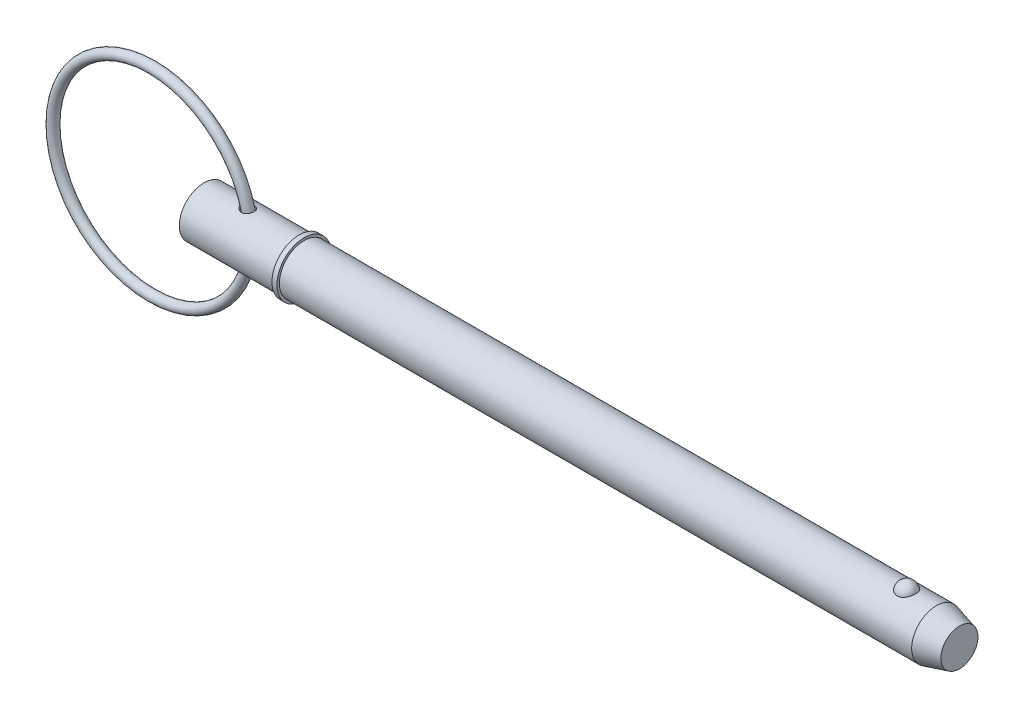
ISO-10303-21;
HEADER;
FILE_DESCRIPTION(('STEP AP214'),'2;1');
FILE_NAME('part.step','',(''),(''),'','','');
FILE_SCHEMA(('AUTOMOTIVE_DESIGN { 1 0 10303 214 1 1 1 1 }'));
ENDSEC;
DATA;
#1=APPLICATION_CONTEXT('core data for automotive mechanical design processes');
#2=APPLICATION_PROTOCOL_DEFINITION('international standard','automotive_design',2000,#1);
#3=PRODUCT_CONTEXT('',#1,'mechanical');
#4=PRODUCT('Part','Part','',(#3));
#5=PRODUCT_RELATED_PRODUCT_CATEGORY('part','',(#4));
#6=PRODUCT_DEFINITION_FORMATION('','',#4);
#7=PRODUCT_DEFINITION_CONTEXT('part definition',#1,'design');
#8=PRODUCT_DEFINITION('design','',#6,#7);
#9=PRODUCT_DEFINITION_SHAPE('','',#8);
#10=(LENGTH_UNIT() NAMED_UNIT(*) SI_UNIT(.MILLI.,.METRE.));
#11=(NAMED_UNIT(*) PLANE_ANGLE_UNIT() SI_UNIT($,.RADIAN.));
#12=(NAMED_UNIT(*) SI_UNIT($,.STERADIAN.) SOLID_ANGLE_UNIT());
#13=UNCERTAINTY_MEASURE_WITH_UNIT(LENGTH_MEASURE(1.E-05),#10,'distance_accuracy_value','');
#14=(GEOMETRIC_REPRESENTATION_CONTEXT(3) GLOBAL_UNCERTAINTY_ASSIGNED_CONTEXT((#13)) GLOBAL_UNIT_ASSIGNED_CONTEXT((#10,
#11,#12)) REPRESENTATION_CONTEXT('',''));
#15=CARTESIAN_POINT('',(0.,0.,0.));
#16=DIRECTION('',(0.,0.,1.));
#17=DIRECTION('',(1.,0.,0.));
#18=AXIS2_PLACEMENT_3D('',#15,#16,#17);
#19=CARTESIAN_POINT('',(-13.3798047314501,0.,0.));
#20=DIRECTION('',(0.,0.,1.));
#21=DIRECTION('',(1.,0.,0.));
#22=AXIS2_PLACEMENT_3D('',#19,#20,#21);
#23=TOROIDAL_SURFACE('',#22,25.4,1.27);
#24=CARTESIAN_POINT('',(13.2901952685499,0.,0.));
#25=VERTEX_POINT('',#24);
#26=VERTEX_LOOP('',#25);
#27=FACE_BOUND('',#26,.T.);
#28=ADVANCED_FACE('P0_F12',(#27),#23,.T.);
#29=CLOSED_SHELL('',(#28));
#30=MANIFOLD_SOLID_BREP('P0_B1',#29);
#31=CARTESIAN_POINT('',(0.,0.,0.));
#32=DIRECTION('',(1.,0.,0.));
#33=DIRECTION('',(0.,0.,-1.));
#34=AXIS2_PLACEMENT_3D('',#31,#32,#33);
#35=CYLINDRICAL_SURFACE('',#34,6.35);
#36=CARTESIAN_POINT('',(9.67500140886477,6.32698634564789,-0.540133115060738));
#37=CARTESIAN_POINT('',(9.70878953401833,6.3197498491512,-0.624879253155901));
#38=CARTESIAN_POINT('',(9.75028044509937,6.31105328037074,-0.706504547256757));
#39=CARTESIAN_POINT('',(9.84659255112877,6.29180070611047,-0.861319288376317));
#40=CARTESIAN_POINT('',(9.90144039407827,6.28124099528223,-0.934491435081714));
#41=CARTESIAN_POINT('',(10.021999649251,6.25949497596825,-1.0704877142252));
#42=CARTESIAN_POINT('',(10.0876589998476,6.2483118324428,-1.1333586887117));
#43=CARTESIAN_POINT('',(10.2280180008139,6.22641783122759,-1.24805262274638));
#44=CARTESIAN_POINT('',(10.3027159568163,6.21570688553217,-1.29987764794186));
#45=CARTESIAN_POINT('',(10.4650889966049,6.19509606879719,-1.39492899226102));
#46=CARTESIAN_POINT('',(10.5533142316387,6.1853135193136,-1.4372443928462));
#47=CARTESIAN_POINT('',(10.7357818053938,6.16871128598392,-1.50691441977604));
#48=CARTESIAN_POINT('',(10.8300253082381,6.16189217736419,-1.53426614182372));
#49=CARTESIAN_POINT('',(11.0227953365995,6.15211299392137,-1.57302798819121));
#50=CARTESIAN_POINT('',(11.1213511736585,6.14918579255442,-1.58430237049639));
#51=CARTESIAN_POINT('',(11.3189518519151,6.1478413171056,-1.58951619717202));
#52=CARTESIAN_POINT('',(11.417996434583,6.14942187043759,-1.58346399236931));
#53=CARTESIAN_POINT('',(11.6070859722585,6.15678569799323,-1.55457003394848));
#54=CARTESIAN_POINT('',(11.6973059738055,6.16229943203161,-1.53280404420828));
#55=CARTESIAN_POINT('',(11.8723373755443,6.176630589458,-1.4739892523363));
#56=CARTESIAN_POINT('',(11.9571502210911,6.185447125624,-1.43694455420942));
#57=CARTESIAN_POINT('',(12.1146737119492,6.20482821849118,-1.3507217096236));
#58=CARTESIAN_POINT('',(12.1877743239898,6.21528554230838,-1.30222952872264));
#59=CARTESIAN_POINT('',(12.324618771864,6.23705116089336,-1.19362916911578));
#60=CARTESIAN_POINT('',(12.3883628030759,6.24835943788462,-1.1335212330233));
#61=CARTESIAN_POINT('',(12.5046662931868,6.27053957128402,-1.00357204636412));
#62=CARTESIAN_POINT('',(12.5572571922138,6.28141258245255,-0.933759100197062));
#63=CARTESIAN_POINT('',(12.6502125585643,6.30157953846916,-0.786214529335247));
#64=CARTESIAN_POINT('',(12.6905764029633,6.31087340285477,-0.708482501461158));
#65=CARTESIAN_POINT('',(12.7585531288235,6.32699259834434,-0.546246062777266));
#66=CARTESIAN_POINT('',(12.7860022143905,6.33378599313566,-0.461669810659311));
#67=CARTESIAN_POINT('',(12.8267605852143,6.34401050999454,-0.288980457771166));
#68=CARTESIAN_POINT('',(12.8400695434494,6.34744155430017,-0.200867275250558));
#69=CARTESIAN_POINT('',(12.8522644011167,6.35058177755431,-0.0231943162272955));
#70=CARTESIAN_POINT('',(12.8510870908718,6.35027464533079,0.0663700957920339));
#71=CARTESIAN_POINT('',(12.8341831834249,6.34593169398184,0.244024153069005));
#72=CARTESIAN_POINT('',(12.8184563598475,6.341895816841,0.332113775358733));
#73=CARTESIAN_POINT('',(12.7728208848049,6.33052992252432,0.504322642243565));
#74=CARTESIAN_POINT('',(12.7429114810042,6.32319973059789,0.588441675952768));
#75=CARTESIAN_POINT('',(12.6696162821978,6.30604116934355,0.750316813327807));
#76=CARTESIAN_POINT('',(12.6262302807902,6.29621276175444,0.828072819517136));
#77=CARTESIAN_POINT('',(12.5270856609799,6.27515240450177,0.974918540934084));
#78=CARTESIAN_POINT('',(12.4713403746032,6.26392197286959,1.04401746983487));
#79=CARTESIAN_POINT('',(12.3488662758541,6.24131002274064,1.1716478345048));
#80=CARTESIAN_POINT('',(12.2821384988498,6.22992851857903,1.23018026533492));
#81=CARTESIAN_POINT('',(12.1401870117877,6.20841765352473,1.33449214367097));
#82=CARTESIAN_POINT('',(12.0650507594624,6.19827734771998,1.38038832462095));
#83=CARTESIAN_POINT('',(11.9079044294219,6.18026478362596,1.45892404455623));
#84=CARTESIAN_POINT('',(11.8258951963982,6.17239224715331,1.49156520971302));
#85=CARTESIAN_POINT('',(11.6581736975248,6.15982613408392,1.54263810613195));
#86=CARTESIAN_POINT('',(11.572502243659,6.15510409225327,1.56119728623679));
#87=CARTESIAN_POINT('',(11.3991899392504,6.14916283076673,1.58443707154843));
#88=CARTESIAN_POINT('',(11.3115488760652,6.14794399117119,1.58911617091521));
#89=CARTESIAN_POINT('',(11.1345547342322,6.14904466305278,1.58485137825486));
#90=CARTESIAN_POINT('',(11.0452104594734,6.15144894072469,1.5755811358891));
#91=CARTESIAN_POINT('',(10.8691479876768,6.15957601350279,1.54349959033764));
#92=CARTESIAN_POINT('',(10.782430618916,6.16529984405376,1.52068406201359));
#93=CARTESIAN_POINT('',(10.6082848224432,6.17983892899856,1.4605156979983));
#94=CARTESIAN_POINT('',(10.5211557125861,6.1888262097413,1.42233764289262));
#95=CARTESIAN_POINT('',(10.3542377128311,6.20874782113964,1.33268652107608));
#96=CARTESIAN_POINT('',(10.2744521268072,6.21968302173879,1.28120750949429));
#97=CARTESIAN_POINT('',(10.120854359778,6.24282707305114,1.16334748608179));
#98=CARTESIAN_POINT('',(10.0474902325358,6.25507146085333,1.09638652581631));
#99=CARTESIAN_POINT('',(9.91368693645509,6.27890019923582,0.950453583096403));
#100=CARTESIAN_POINT('',(9.85324511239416,6.29048468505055,0.87148407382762));
#101=CARTESIAN_POINT('',(9.75037543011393,6.31102161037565,0.707140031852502));
#102=CARTESIAN_POINT('',(9.70726585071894,6.32006820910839,0.622206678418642));
#103=CARTESIAN_POINT('',(9.63775895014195,6.33497125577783,0.445490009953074));
#104=CARTESIAN_POINT('',(9.61134627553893,6.34083063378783,0.35371307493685));
#105=CARTESIAN_POINT('',(9.57891955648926,6.34807071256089,0.177220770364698));
#106=CARTESIAN_POINT('',(9.5709352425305,6.3498832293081,0.0928817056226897));
#107=CARTESIAN_POINT('',(9.56994851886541,6.35010532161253,-0.0758268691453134));
#108=CARTESIAN_POINT('',(9.57692695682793,6.34851924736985,-0.160196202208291));
#109=CARTESIAN_POINT('',(9.59985709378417,6.34339435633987,-0.294043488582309));
#110=CARTESIAN_POINT('',(9.61128951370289,6.34084912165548,-0.34438537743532));
#111=CARTESIAN_POINT('',(9.63933183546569,6.33468615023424,-0.443526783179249));
#112=CARTESIAN_POINT('',(9.65594100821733,6.33106856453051,-0.492326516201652));
#113=CARTESIAN_POINT('',(9.67500140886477,6.32698634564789,-0.540133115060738));
#114=B_SPLINE_CURVE_WITH_KNOTS('',3,(#36,#37,#38,#39,#40,#41,#42,#43,#44,#45,#46,#47,#48,#49,
#50,#51,#52,#53,#54,#55,#56,#57,#58,#59,#60,#61,#62,#63,#64,#65,#66,#67,#68,#69,#70,#71,#72,#73,
#74,#75,#76,#77,#78,#79,#80,#81,#82,#83,#84,#85,#86,#87,#88,#89,#90,#91,#92,#93,#94,#95,#96,#97,
#98,#99,#100,#101,#102,#103,#104,#105,#106,#107,#108,#109,#110,#111,#112,#113),.UNSPECIFIED.,
.T.,.F.,(4,2,2,2,2,2,2,2,2,2,2,2,2,2,2,2,2,2,2,2,2,2,2,2,2,2,2,2,2,2,2,2,2,2,2,2,2,2,4),(0.,
0.274348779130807,0.54924945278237,0.822863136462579,1.09642560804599,1.3900770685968,
1.68378550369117,1.97995934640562,2.27599046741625,2.55347281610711,2.83088067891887,
3.09465189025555,3.35841759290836,3.62142956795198,3.88445494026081,4.1507318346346,
4.4170148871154,4.68446025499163,4.95190978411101,5.21937350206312,5.48684131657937,
5.75402200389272,6.02117751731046,6.28577524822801,6.55034050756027,6.81248178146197,
7.0746514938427,7.34305086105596,7.61153399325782,7.89692981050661,8.18245340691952,
8.48120635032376,8.77989784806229,9.06530254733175,9.35044442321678,9.60331609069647,
9.85586427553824,10.010650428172,10.1654147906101),.UNSPECIFIED.);
#115=CARTESIAN_POINT('',(9.67500140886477,6.32698634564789,-0.540133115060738));
#116=VERTEX_POINT('',#115);
#117=EDGE_CURVE('P1_E42',#116,#116,#114,.T.);
#118=ORIENTED_EDGE('',*,*,#117,.T.);
#119=EDGE_LOOP('',(#118));
#120=FACE_BOUND('',#119,.T.);
#121=CARTESIAN_POINT('',(0.,0.,0.));
#122=DIRECTION('',(1.,0.,0.));
#123=DIRECTION('',(0.,0.,-1.));
#124=AXIS2_PLACEMENT_3D('',#121,#122,#123);
#125=CIRCLE('',#124,6.35);
#126=CARTESIAN_POINT('',(0.,0.,-6.35));
#127=VERTEX_POINT('',#126);
#128=EDGE_CURVE('P1_E9',#127,#127,#125,.T.);
#129=ORIENTED_EDGE('',*,*,#128,.T.);
#130=EDGE_LOOP('',(#129));
#131=FACE_BOUND('',#130,.T.);
#132=CARTESIAN_POINT('',(24.43,0.,0.));
#133=DIRECTION('',(1.,0.,0.));
#134=DIRECTION('',(0.,0.,-1.));
#135=AXIS2_PLACEMENT_3D('',#132,#133,#134);
#136=CIRCLE('',#135,6.35);
#137=CARTESIAN_POINT('',(24.43,0.,-6.35));
#138=VERTEX_POINT('',#137);
#139=EDGE_CURVE('P1_E25',#138,#138,#136,.T.);
#140=ORIENTED_EDGE('',*,*,#139,.F.);
#141=EDGE_LOOP('',(#140));
#142=FACE_BOUND('',#141,.T.);
#143=CARTESIAN_POINT('',(9.67500140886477,-6.32698634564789,-0.540133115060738));
#144=CARTESIAN_POINT('',(9.64544894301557,-6.33331515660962,-0.46600258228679));
#145=CARTESIAN_POINT('',(9.62177180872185,-6.33852974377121,-0.389437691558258));
#146=CARTESIAN_POINT('',(9.58727043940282,-6.34619174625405,-0.233330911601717));
#147=CARTESIAN_POINT('',(9.57644043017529,-6.34864040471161,-0.153790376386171));
#148=CARTESIAN_POINT('',(9.56819517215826,-6.3505010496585,0.00612071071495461));
#149=CARTESIAN_POINT('',(9.57079639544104,-6.34990930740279,0.0864921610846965));
#150=CARTESIAN_POINT('',(9.58930797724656,-6.3457478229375,0.245607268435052));
#151=CARTESIAN_POINT('',(9.60522046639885,-6.34217760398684,0.324350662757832));
#152=CARTESIAN_POINT('',(9.64931570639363,-6.3324977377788,0.47727605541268));
#153=CARTESIAN_POINT('',(9.67737525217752,-6.32641361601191,0.551495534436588));
#154=CARTESIAN_POINT('',(9.74451510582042,-6.31231128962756,0.69455132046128));
#155=CARTESIAN_POINT('',(9.78359827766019,-6.30429258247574,0.763386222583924));
#156=CARTESIAN_POINT('',(9.87474700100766,-6.28638332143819,0.899414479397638));
#157=CARTESIAN_POINT('',(9.92757481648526,-6.27639669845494,0.966083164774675));
#158=CARTESIAN_POINT('',(10.042675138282,-6.25596164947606,1.09061181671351));
#159=CARTESIAN_POINT('',(10.1049521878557,-6.24551300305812,1.14846751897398));
#160=CARTESIAN_POINT('',(10.2445505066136,-6.22397505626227,1.26024641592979));
#161=CARTESIAN_POINT('',(10.3227711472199,-6.2129394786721,1.31305951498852));
#162=CARTESIAN_POINT('',(10.4867924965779,-6.19263757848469,1.40570084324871));
#163=CARTESIAN_POINT('',(10.5725962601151,-6.18337197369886,1.44552380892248));
#164=CARTESIAN_POINT('',(10.7543302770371,-6.16725983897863,1.51283687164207));
#165=CARTESIAN_POINT('',(10.8505554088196,-6.16056505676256,1.53957358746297));
#166=CARTESIAN_POINT('',(11.0463546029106,-6.15127671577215,1.57628137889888));
#167=CARTESIAN_POINT('',(11.1459276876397,-6.14868197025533,1.58625730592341));
#168=CARTESIAN_POINT('',(11.3414257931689,-6.14810798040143,1.58848000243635));
#169=CARTESIAN_POINT('',(11.4373417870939,-6.14995283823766,1.58140242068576));
#170=CARTESIAN_POINT('',(11.6262783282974,-6.1577972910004,1.55057566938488));
#171=CARTESIAN_POINT('',(11.719300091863,-6.16379511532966,1.52683360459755));
#172=CARTESIAN_POINT('',(11.8934223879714,-6.17873566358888,1.46514575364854));
#173=CARTESIAN_POINT('',(11.9749048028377,-6.18746207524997,1.42822144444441));
#174=CARTESIAN_POINT('',(12.1301362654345,-6.20693584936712,1.34105645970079));
#175=CARTESIAN_POINT('',(12.2038861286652,-6.21768299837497,1.29081719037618));
#176=CARTESIAN_POINT('',(12.3399792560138,-6.23970077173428,1.17972764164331));
#177=CARTESIAN_POINT('',(12.4025430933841,-6.25095401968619,1.11914355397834));
#178=CARTESIAN_POINT('',(12.5166805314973,-6.27296916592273,0.988307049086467));
#179=CARTESIAN_POINT('',(12.568253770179,-6.28373104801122,0.918054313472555));
#180=CARTESIAN_POINT('',(12.6596230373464,-6.3037060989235,0.769081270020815));
#181=CARTESIAN_POINT('',(12.6992956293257,-6.31290263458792,0.690283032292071));
#182=CARTESIAN_POINT('',(12.7652258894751,-6.32862394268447,0.527011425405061));
#183=CARTESIAN_POINT('',(12.7914829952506,-6.33514860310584,0.442537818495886));
#184=CARTESIAN_POINT('',(12.8301436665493,-6.34487485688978,0.269505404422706));
#185=CARTESIAN_POINT('',(12.8424230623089,-6.34804664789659,0.180917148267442));
#186=CARTESIAN_POINT('',(12.8524214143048,-6.35062347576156,0.00286829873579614));
#187=CARTESIAN_POINT('',(12.8501402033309,-6.35002846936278,-0.0865923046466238));
#188=CARTESIAN_POINT('',(12.8310619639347,-6.34513332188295,-0.263931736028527));
#189=CARTESIAN_POINT('',(12.8142517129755,-6.34082980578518,-0.35180904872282));
#190=CARTESIAN_POINT('',(12.7664911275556,-6.32897674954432,-0.523406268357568));
#191=CARTESIAN_POINT('',(12.7355404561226,-6.3214271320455,-0.607126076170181));
#192=CARTESIAN_POINT('',(12.6602298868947,-6.30390232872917,-0.768030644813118));
#193=CARTESIAN_POINT('',(12.6158695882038,-6.29392707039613,-0.845215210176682));
#194=CARTESIAN_POINT('',(12.5148171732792,-6.2726521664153,-0.990836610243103));
#195=CARTESIAN_POINT('',(12.4581254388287,-6.26135256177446,-1.05927371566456));
#196=CARTESIAN_POINT('',(12.33416419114,-6.2387572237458,-1.18510935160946));
#197=CARTESIAN_POINT('',(12.2669484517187,-6.22746174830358,-1.24256086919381));
#198=CARTESIAN_POINT('',(12.1235592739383,-6.20610255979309,-1.34519464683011));
#199=CARTESIAN_POINT('',(12.0473871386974,-6.19603866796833,-1.39037868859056));
#200=CARTESIAN_POINT('',(11.8892714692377,-6.17839642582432,-1.46678006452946));
#201=CARTESIAN_POINT('',(11.8074126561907,-6.17078838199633,-1.49816605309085));
#202=CARTESIAN_POINT('',(11.6394563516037,-6.15869606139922,-1.54712759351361));
#203=CARTESIAN_POINT('',(11.5533589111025,-6.15421174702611,-1.56470331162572));
#204=CARTESIAN_POINT('',(11.3789660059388,-6.14876652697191,-1.58596734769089));
#205=CARTESIAN_POINT('',(11.2906621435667,-6.1478222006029,-1.58959032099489));
#206=CARTESIAN_POINT('',(11.1146029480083,-6.149490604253,-1.58312110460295));
#207=CARTESIAN_POINT('',(11.0268477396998,-6.1521041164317,-1.57302589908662));
#208=CARTESIAN_POINT('',(10.8498668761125,-6.16071031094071,-1.53898332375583));
#209=CARTESIAN_POINT('',(10.7607726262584,-6.16685908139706,-1.51439468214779));
#210=CARTESIAN_POINT('',(10.5876521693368,-6.18189031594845,-1.45181305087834));
#211=CARTESIAN_POINT('',(10.5036282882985,-6.19077402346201,-1.41381396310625));
#212=CARTESIAN_POINT('',(10.3374228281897,-6.2109378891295,-1.32252480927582));
#213=CARTESIAN_POINT('',(10.255708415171,-6.2223355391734,-1.26840756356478));
#214=CARTESIAN_POINT('',(10.1025645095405,-6.24580740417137,-1.14725208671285));
#215=CARTESIAN_POINT('',(10.0311354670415,-6.25788164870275,-1.08021329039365));
#216=CARTESIAN_POINT('',(9.90472699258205,-6.2806176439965,-0.938710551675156));
#217=CARTESIAN_POINT('',(9.84904456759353,-6.29132066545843,-0.864883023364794));
#218=CARTESIAN_POINT('',(9.75129345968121,-6.31084098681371,-0.708496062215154));
#219=CARTESIAN_POINT('',(9.70921094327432,-6.31966019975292,-0.625945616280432));
#220=CARTESIAN_POINT('',(9.67500140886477,-6.32698634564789,-0.540133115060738));
#221=B_SPLINE_CURVE_WITH_KNOTS('',3,(#143,#144,#145,#146,#147,#148,#149,#150,#151,#152,#153,
#154,#155,#156,#157,#158,#159,#160,#161,#162,#163,#164,#165,#166,#167,#168,#169,#170,#171,#172,
#173,#174,#175,#176,#177,#178,#179,#180,#181,#182,#183,#184,#185,#186,#187,#188,#189,#190,#191,
#192,#193,#194,#195,#196,#197,#198,#199,#200,#201,#202,#203,#204,#205,#206,#207,#208,#209,#210,
#211,#212,#213,#214,#215,#216,#217,#218,#219,#220),.UNSPECIFIED.,.T.,.F.,(4,2,2,2,2,2,2,2,2,2,2,
2,2,2,2,2,2,2,2,2,2,2,2,2,2,2,2,2,2,2,2,2,2,2,2,2,2,2,4),(0.,0.239871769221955,
0.479635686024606,0.719693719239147,0.959790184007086,1.19750645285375,1.43528453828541,
1.69117930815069,1.94719750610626,2.23102979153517,2.51497694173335,2.81376497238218,
3.11246650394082,3.39952951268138,3.68647020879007,3.95479420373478,4.22308987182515,
4.48530700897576,4.74753278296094,5.01239119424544,5.27726070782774,5.54446524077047,
5.81167284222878,6.07912387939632,6.34658129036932,6.61404669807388,6.88150382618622,
7.1476364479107,7.41373039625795,7.67647472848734,7.93921589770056,8.20318607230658,
8.46721428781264,8.74390821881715,9.02072813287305,9.31537622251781,9.61003720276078,
9.88799314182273,10.1656654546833),.UNSPECIFIED.);
#222=CARTESIAN_POINT('',(9.67500140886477,-6.32698634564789,-0.540133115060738));
#223=VERTEX_POINT('',#222);
#224=EDGE_CURVE('P1_E17',#223,#223,#221,.T.);
#225=ORIENTED_EDGE('',*,*,#224,.T.);
#226=EDGE_LOOP('',(#225));
#227=FACE_BOUND('',#226,.T.);
#228=ADVANCED_FACE('P1_F13',(#120,#131,#142,#227),#35,.T.);
#229=CARTESIAN_POINT('',(0.,0.,0.));
#230=DIRECTION('',(1.,0.,0.));
#231=DIRECTION('',(0.,0.,-1.));
#232=AXIS2_PLACEMENT_3D('',#229,#230,#231);
#233=CYLINDRICAL_SURFACE('',#232,6.35);
#234=CARTESIAN_POINT('',(188.055369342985,0.,0.));
#235=DIRECTION('',(1.,0.,0.));
#236=DIRECTION('',(0.,0.,-1.));
#237=AXIS2_PLACEMENT_3D('',#234,#235,#236);
#238=CIRCLE('',#237,6.35);
#239=CARTESIAN_POINT('',(188.055369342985,0.,-6.35));
#240=VERTEX_POINT('',#239);
#241=EDGE_CURVE('P1_E99',#240,#240,#238,.T.);
#242=ORIENTED_EDGE('',*,*,#241,.F.);
#243=EDGE_LOOP('',(#242));
#244=FACE_BOUND('',#243,.T.);
#245=CARTESIAN_POINT('',(25.7,0.,0.));
#246=DIRECTION('',(1.,0.,0.));
#247=DIRECTION('',(0.,0.,-1.));
#248=AXIS2_PLACEMENT_3D('',#245,#246,#247);
#249=CIRCLE('',#248,6.35);
#250=CARTESIAN_POINT('',(25.7,0.,-6.35));
#251=VERTEX_POINT('',#250);
#252=EDGE_CURVE('P1_E96',#251,#251,#249,.T.);
#253=ORIENTED_EDGE('',*,*,#252,.T.);
#254=EDGE_LOOP('',(#253));
#255=FACE_BOUND('',#254,.T.);
#256=CARTESIAN_POINT('',(180.430021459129,5.87502187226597,2.40969251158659));
#257=CARTESIAN_POINT('',(180.305030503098,5.87501645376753,2.40969773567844));
#258=CARTESIAN_POINT('',(180.180080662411,5.87916061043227,2.39967292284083));
#259=CARTESIAN_POINT('',(179.933909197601,5.8952311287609,2.35991730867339));
#260=CARTESIAN_POINT('',(179.812686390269,5.90715499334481,2.33019283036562));
#261=CARTESIAN_POINT('',(179.577517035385,5.93739567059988,2.25201402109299));
#262=CARTESIAN_POINT('',(179.463560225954,5.95570321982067,2.20358681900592));
#263=CARTESIAN_POINT('',(179.24557352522,5.9967206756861,2.089379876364));
#264=CARTESIAN_POINT('',(179.141545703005,6.01943149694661,2.02359652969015));
#265=CARTESIAN_POINT('',(178.942943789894,6.06760647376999,1.87428969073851));
#266=CARTESIAN_POINT('',(178.848726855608,6.09313095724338,1.79031110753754));
#267=CARTESIAN_POINT('',(178.675255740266,6.14375873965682,1.60800178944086));
#268=CARTESIAN_POINT('',(178.596004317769,6.16886196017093,1.50966841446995));
#269=CARTESIAN_POINT('',(178.450845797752,6.21724600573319,1.29645884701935));
#270=CARTESIAN_POINT('',(178.385688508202,6.24039621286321,1.18104158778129));
#271=CARTESIAN_POINT('',(178.274703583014,6.28117277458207,0.940351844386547));
#272=CARTESIAN_POINT('',(178.228877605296,6.29879865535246,0.815078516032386));
#273=CARTESIAN_POINT('',(178.157023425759,6.32692073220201,0.556494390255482));
#274=CARTESIAN_POINT('',(178.131249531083,6.33732517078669,0.423102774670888));
#275=CARTESIAN_POINT('',(178.100988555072,6.34957673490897,0.153542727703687));
#276=CARTESIAN_POINT('',(178.096500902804,6.35142408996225,0.0173743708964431));
#277=CARTESIAN_POINT('',(178.108865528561,6.34638925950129,-0.253036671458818));
#278=CARTESIAN_POINT('',(178.125594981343,6.33955731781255,-0.387285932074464));
#279=CARTESIAN_POINT('',(178.179843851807,6.31794129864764,-0.650851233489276));
#280=CARTESIAN_POINT('',(178.217363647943,6.30315707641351,-0.780167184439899));
#281=CARTESIAN_POINT('',(178.312500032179,6.26711642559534,-1.03041949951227));
#282=CARTESIAN_POINT('',(178.370143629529,6.24585130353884,-1.1513443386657));
#283=CARTESIAN_POINT('',(178.504352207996,6.19905619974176,-1.38129800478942));
#284=CARTESIAN_POINT('',(178.580918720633,6.17352587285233,-1.49032586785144));
#285=CARTESIAN_POINT('',(178.751753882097,6.12080227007,-1.69393164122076));
#286=CARTESIAN_POINT('',(178.846100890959,6.09360200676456,-1.78844209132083));
#287=CARTESIAN_POINT('',(179.050119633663,6.04070434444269,-1.95970536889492));
#288=CARTESIAN_POINT('',(179.159790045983,6.01500681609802,-2.03645972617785));
#289=CARTESIAN_POINT('',(179.389187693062,5.96867714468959,-2.16845644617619));
#290=CARTESIAN_POINT('',(179.508652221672,5.94794910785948,-2.22412062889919));
#291=CARTESIAN_POINT('',(179.756218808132,5.91340580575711,-2.31440992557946));
#292=CARTESIAN_POINT('',(179.884317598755,5.8995879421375,-2.3490429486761));
#293=CARTESIAN_POINT('',(180.138582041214,5.88111049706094,-2.39491590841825));
#294=CARTESIAN_POINT('',(180.264520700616,5.876025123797,-2.40724512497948));
#295=CARTESIAN_POINT('',(180.516786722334,5.87428980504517,-2.41147867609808));
#296=CARTESIAN_POINT('',(180.643114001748,5.87763817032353,-2.40338710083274));
#297=CARTESIAN_POINT('',(180.888417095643,5.89212921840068,-2.367627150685));
#298=CARTESIAN_POINT('',(181.007499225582,5.90302431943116,-2.34058030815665));
#299=CARTESIAN_POINT('',(181.23924472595,5.93113752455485,-2.26839066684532));
#300=CARTESIAN_POINT('',(181.351907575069,5.94835614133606,-2.22324640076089));
#301=CARTESIAN_POINT('',(181.570400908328,5.98773016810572,-2.11493806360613));
#302=CARTESIAN_POINT('',(181.676028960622,6.00998499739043,-2.05140269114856));
#303=CARTESIAN_POINT('',(181.875300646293,6.05690144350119,-1.90842705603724));
#304=CARTESIAN_POINT('',(181.968941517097,6.08156361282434,-1.82898313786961));
#305=CARTESIAN_POINT('',(182.146675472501,6.13211715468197,-1.65182429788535));
#306=CARTESIAN_POINT('',(182.230055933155,6.15800825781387,-1.55339381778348));
#307=CARTESIAN_POINT('',(182.379790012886,6.20712834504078,-1.34374214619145));
#308=CARTESIAN_POINT('',(182.446140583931,6.23035685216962,-1.23251867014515));
#309=CARTESIAN_POINT('',(182.562345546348,6.27251177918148,-0.996447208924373));
#310=CARTESIAN_POINT('',(182.611607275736,6.29127762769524,-0.871278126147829));
#311=CARTESIAN_POINT('',(182.689614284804,6.3215862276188,-0.613870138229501));
#312=CARTESIAN_POINT('',(182.718359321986,6.33312889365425,-0.481631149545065));
#313=CARTESIAN_POINT('',(182.754770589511,6.34782349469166,-0.213672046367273));
#314=CARTESIAN_POINT('',(182.762413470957,6.35096613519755,-0.0779482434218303));
#315=CARTESIAN_POINT('',(182.756395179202,6.34851322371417,0.192943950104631));
#316=CARTESIAN_POINT('',(182.742734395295,6.3429178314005,0.328112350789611));
#317=CARTESIAN_POINT('',(182.69450361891,6.32360512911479,0.593406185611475));
#318=CARTESIAN_POINT('',(182.660031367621,6.30992579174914,0.723552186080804));
#319=CARTESIAN_POINT('',(182.570953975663,6.27586325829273,0.97583417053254));
#320=CARTESIAN_POINT('',(182.51634761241,6.25547965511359,1.09796966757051));
#321=CARTESIAN_POINT('',(182.38775879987,6.20998183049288,1.33148921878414));
#322=CARTESIAN_POINT('',(182.313674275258,6.18484288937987,1.44281227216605));
#323=CARTESIAN_POINT('',(182.147820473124,6.13258735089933,1.65087683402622));
#324=CARTESIAN_POINT('',(182.056051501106,6.10547078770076,1.74761859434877));
#325=CARTESIAN_POINT('',(181.857183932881,6.05235879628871,1.92350926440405));
#326=CARTESIAN_POINT('',(181.750133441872,6.0263601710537,2.00271146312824));
#327=CARTESIAN_POINT('',(181.523138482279,5.97843747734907,2.1415415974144));
#328=CARTESIAN_POINT('',(181.403191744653,5.95651412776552,2.20116608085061));
#329=CARTESIAN_POINT('',(181.144523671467,5.91812106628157,2.30250570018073));
#330=CARTESIAN_POINT('',(181.00506980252,5.90217533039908,2.34256795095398));
#331=CARTESIAN_POINT('',(180.720397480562,5.88063128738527,2.39615214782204));
#332=CARTESIAN_POINT('',(180.57518174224,5.8750281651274,2.40968644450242));
#333=CARTESIAN_POINT('',(180.430021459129,5.87502187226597,2.40969251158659));
#334=B_SPLINE_CURVE_WITH_KNOTS('',3,(#256,#257,#258,#259,#260,#261,#262,#263,#264,#265,#266,
#267,#268,#269,#270,#271,#272,#273,#274,#275,#276,#277,#278,#279,#280,#281,#282,#283,#284,#285,
#286,#287,#288,#289,#290,#291,#292,#293,#294,#295,#296,#297,#298,#299,#300,#301,#302,#303,#304,
#305,#306,#307,#308,#309,#310,#311,#312,#313,#314,#315,#316,#317,#318,#319,#320,#321,#322,#323,
#324,#325,#326,#327,#328,#329,#330,#331,#332,#333),.UNSPECIFIED.,.T.,.F.,(4,2,2,2,2,2,2,2,2,2,2,
2,2,2,2,2,2,2,2,2,2,2,2,2,2,2,2,2,2,2,2,2,2,2,2,2,2,2,4),(0.,0.374440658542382,
0.748761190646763,1.1225407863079,1.49639810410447,1.88098871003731,2.2656501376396,
2.66741104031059,3.06920639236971,3.47601794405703,3.88281858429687,4.28727498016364,
4.69173873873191,5.09674745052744,5.50178895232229,5.9086591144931,6.31549420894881,
6.71369855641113,7.11175305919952,7.48978077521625,7.86773278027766,8.23383886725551,
8.59997464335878,8.97409044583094,9.34829231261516,9.74122667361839,10.1342313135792,
10.5397522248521,10.9452779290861,11.3512521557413,11.7572189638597,12.1612938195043,
12.5653932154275,12.9716540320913,13.3779078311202,13.7829098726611,14.1879832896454,
14.6230486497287,15.0579114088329),.UNSPECIFIED.);
#335=CARTESIAN_POINT('',(180.430021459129,5.87502187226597,2.40969251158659));
#336=VERTEX_POINT('',#335);
#337=EDGE_CURVE('P1_E34',#336,#336,#334,.T.);
#338=ORIENTED_EDGE('',*,*,#337,.T.);
#339=EDGE_LOOP('',(#338));
#340=FACE_BOUND('',#339,.T.);
#341=ADVANCED_FACE('P1_F46',(#244,#255,#340),#233,.T.);
#342=CARTESIAN_POINT('',(0.,0.,0.));
#343=DIRECTION('',(-1.,0.,0.));
#344=DIRECTION('',(0.,0.,1.));
#345=AXIS2_PLACEMENT_3D('',#342,#343,#344);
#346=PLANE('',#345);
#347=ORIENTED_EDGE('',*,*,#128,.F.);
#348=EDGE_LOOP('',(#347));
#349=FACE_BOUND('',#348,.T.);
#350=ADVANCED_FACE('P1_F15',(#349),#346,.T.);
#351=CARTESIAN_POINT('',(24.43,6.35,0.));
#352=DIRECTION('',(-1.,0.,0.));
#353=DIRECTION('',(0.,0.,1.));
#354=AXIS2_PLACEMENT_3D('',#351,#352,#353);
#355=PLANE('',#354);
#356=ORIENTED_EDGE('',*,*,#139,.T.);
#357=EDGE_LOOP('',(#356));
#358=FACE_BOUND('',#357,.T.);
#359=CARTESIAN_POINT('',(24.43,0.,0.));
#360=DIRECTION('',(1.,0.,0.));
#361=DIRECTION('',(0.,0.,-1.));
#362=AXIS2_PLACEMENT_3D('',#359,#360,#361);
#363=CIRCLE('',#362,6.985);
#364=CARTESIAN_POINT('',(24.43,0.,-6.985));
#365=VERTEX_POINT('',#364);
#366=EDGE_CURVE('P1_E30',#365,#365,#363,.T.);
#367=ORIENTED_EDGE('',*,*,#366,.F.);
#368=EDGE_LOOP('',(#367));
#369=FACE_BOUND('',#368,.T.);
#370=ADVANCED_FACE('P1_F81',(#358,#369),#355,.T.);
#371=CARTESIAN_POINT('',(0.,0.,0.));
#372=DIRECTION('',(1.,0.,0.));
#373=DIRECTION('',(0.,0.,-1.));
#374=AXIS2_PLACEMENT_3D('',#371,#372,#373);
#375=CYLINDRICAL_SURFACE('',#374,6.985);
#376=ORIENTED_EDGE('',*,*,#366,.T.);
#377=EDGE_LOOP('',(#376));
#378=FACE_BOUND('',#377,.T.);
#379=CARTESIAN_POINT('',(25.7,0.,0.));
#380=DIRECTION('',(1.,0.,0.));
#381=DIRECTION('',(0.,0.,-1.));
#382=AXIS2_PLACEMENT_3D('',#379,#380,#381);
#383=CIRCLE('',#382,6.985);
#384=CARTESIAN_POINT('',(25.7,0.,-6.985));
#385=VERTEX_POINT('',#384);
#386=EDGE_CURVE('P1_E95',#385,#385,#383,.T.);
#387=ORIENTED_EDGE('',*,*,#386,.F.);
#388=EDGE_LOOP('',(#387));
#389=FACE_BOUND('',#388,.T.);
#390=ADVANCED_FACE('P1_F68',(#378,#389),#375,.T.);
#391=CARTESIAN_POINT('',(25.7,6.985,0.));
#392=DIRECTION('',(1.,0.,0.));
#393=DIRECTION('',(0.,0.,-1.));
#394=AXIS2_PLACEMENT_3D('',#391,#392,#393);
#395=PLANE('',#394);
#396=ORIENTED_EDGE('',*,*,#386,.T.);
#397=EDGE_LOOP('',(#396));
#398=FACE_BOUND('',#397,.T.);
#399=ORIENTED_EDGE('',*,*,#252,.F.);
#400=EDGE_LOOP('',(#399));
#401=FACE_BOUND('',#400,.T.);
#402=ADVANCED_FACE('P1_F62',(#398,#401),#395,.T.);
#403=CARTESIAN_POINT('',(193.98,0.,0.));
#404=DIRECTION('',(-1.,0.,0.));
#405=DIRECTION('',(0.,0.,1.));
#406=AXIS2_PLACEMENT_3D('',#403,#404,#405);
#407=CONICAL_SURFACE('',#406,4.76250000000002,0.261799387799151);
#408=ORIENTED_EDGE('',*,*,#241,.T.);
#409=EDGE_LOOP('',(#408));
#410=FACE_BOUND('',#409,.T.);
#411=CARTESIAN_POINT('',(193.98,0.,0.));
#412=DIRECTION('',(1.,0.,0.));
#413=DIRECTION('',(0.,0.,-1.));
#414=AXIS2_PLACEMENT_3D('',#411,#412,#413);
#415=CIRCLE('',#414,4.76250000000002);
#416=CARTESIAN_POINT('',(193.98,0.,-4.76250000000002));
#417=VERTEX_POINT('',#416);
#418=EDGE_CURVE('P1_E41',#417,#417,#415,.T.);
#419=ORIENTED_EDGE('',*,*,#418,.F.);
#420=EDGE_LOOP('',(#419));
#421=FACE_BOUND('',#420,.T.);
#422=ADVANCED_FACE('P1_F59',(#410,#421),#407,.T.);
#423=CARTESIAN_POINT('',(193.98,4.76250000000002,0.));
#424=DIRECTION('',(1.,0.,0.));
#425=DIRECTION('',(0.,0.,-1.));
#426=AXIS2_PLACEMENT_3D('',#423,#424,#425);
#427=PLANE('',#426);
#428=ORIENTED_EDGE('',*,*,#418,.T.);
#429=EDGE_LOOP('',(#428));
#430=FACE_BOUND('',#429,.T.);
#431=ADVANCED_FACE('P1_F55',(#430),#427,.T.);
#432=CARTESIAN_POINT('',(180.430021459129,5.71499999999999,0.));
#433=DIRECTION('',(-1.,0.,0.));
#434=DIRECTION('',(0.,1.,0.));
#435=AXIS2_PLACEMENT_3D('',#432,#433,#434);
#436=SPHERICAL_SURFACE('',#435,2.415);
#437=ORIENTED_EDGE('',*,*,#337,.F.);
#438=EDGE_LOOP('',(#437));
#439=FACE_BOUND('',#438,.T.);
#440=ADVANCED_FACE('P1_F50',(#439),#436,.T.);
#441=CARTESIAN_POINT('',(-13.3798047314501,0.,0.));
#442=DIRECTION('',(0.,0.,1.));
#443=DIRECTION('',(1.,0.,0.));
#444=AXIS2_PLACEMENT_3D('',#441,#442,#443);
#445=TOROIDAL_SURFACE('',#444,25.4,1.5875);
#446=ORIENTED_EDGE('',*,*,#224,.F.);
#447=EDGE_LOOP('',(#446));
#448=FACE_BOUND('',#447,.T.);
#449=ORIENTED_EDGE('',*,*,#117,.F.);
#450=EDGE_LOOP('',(#449));
#451=FACE_BOUND('',#450,.T.);
#452=ADVANCED_FACE('P1_F54',(#448,#451),#445,.F.);
#453=CLOSED_SHELL('',(#228,#341,#350,#370,#390,#402,#422,#431,#440,#452));
#454=MANIFOLD_SOLID_BREP('P1_B1',#453);
#455=ADVANCED_BREP_SHAPE_REPRESENTATION('',(#18,#30,#454),#14);
#456=SHAPE_DEFINITION_REPRESENTATION(#9,#455);
ENDSEC;
END-ISO-10303-21;
